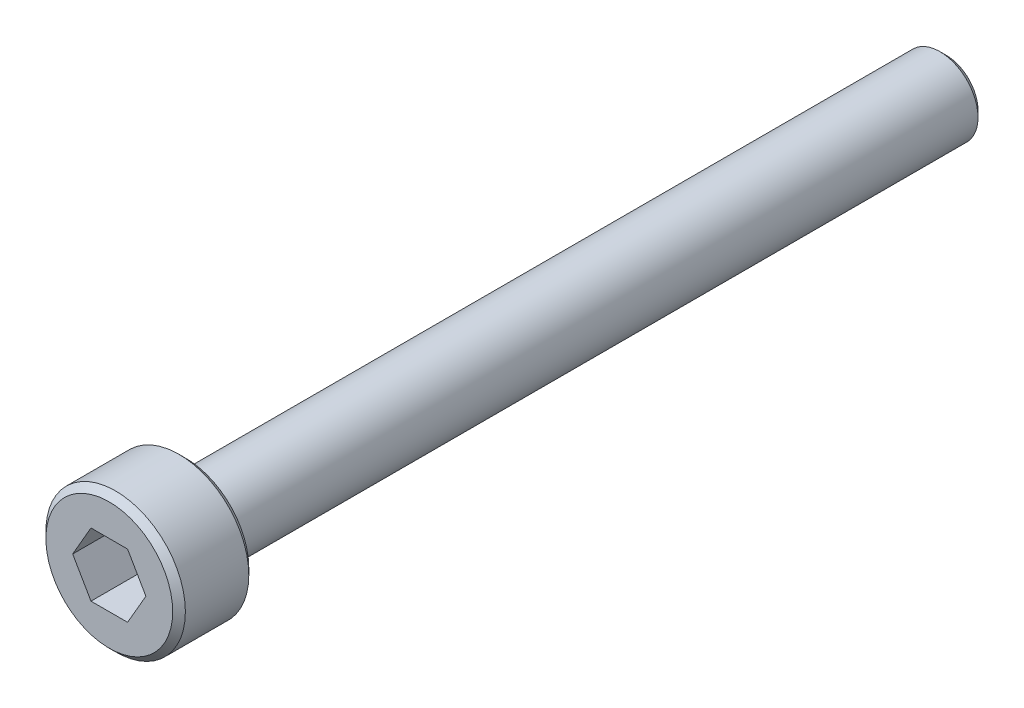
ISO-10303-21;
HEADER;
FILE_DESCRIPTION(('STEP AP214'),'2;1');
FILE_NAME('part.step','',(''),(''),'','','');
FILE_SCHEMA(('AUTOMOTIVE_DESIGN { 1 0 10303 214 1 1 1 1 }'));
ENDSEC;
DATA;
#1=APPLICATION_CONTEXT('core data for automotive mechanical design processes');
#2=APPLICATION_PROTOCOL_DEFINITION('international standard','automotive_design',2000,#1);
#3=PRODUCT_CONTEXT('',#1,'mechanical');
#4=PRODUCT('Part','Part','',(#3));
#5=PRODUCT_RELATED_PRODUCT_CATEGORY('part','',(#4));
#6=PRODUCT_DEFINITION_FORMATION('','',#4);
#7=PRODUCT_DEFINITION_CONTEXT('part definition',#1,'design');
#8=PRODUCT_DEFINITION('design','',#6,#7);
#9=PRODUCT_DEFINITION_SHAPE('','',#8);
#10=(LENGTH_UNIT() NAMED_UNIT(*) SI_UNIT(.MILLI.,.METRE.));
#11=(NAMED_UNIT(*) PLANE_ANGLE_UNIT() SI_UNIT($,.RADIAN.));
#12=(NAMED_UNIT(*) SI_UNIT($,.STERADIAN.) SOLID_ANGLE_UNIT());
#13=UNCERTAINTY_MEASURE_WITH_UNIT(LENGTH_MEASURE(1.E-05),#10,'distance_accuracy_value','');
#14=(GEOMETRIC_REPRESENTATION_CONTEXT(3) GLOBAL_UNCERTAINTY_ASSIGNED_CONTEXT((#13)) GLOBAL_UNIT_ASSIGNED_CONTEXT((#10,
#11,#12)) REPRESENTATION_CONTEXT('',''));
#15=CARTESIAN_POINT('',(0.,0.,0.));
#16=DIRECTION('',(0.,0.,1.));
#17=DIRECTION('',(1.,0.,0.));
#18=AXIS2_PLACEMENT_3D('',#15,#16,#17);
#19=CARTESIAN_POINT('',(0.,0.,30.));
#20=DIRECTION('',(0.,0.,-1.));
#21=DIRECTION('',(-1.,0.,0.));
#22=AXIS2_PLACEMENT_3D('',#19,#20,#21);
#23=CYLINDRICAL_SURFACE('',#22,1.5);
#24=CARTESIAN_POINT('',(0.,0.,0.249999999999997));
#25=DIRECTION('',(0.,0.,1.));
#26=DIRECTION('',(1.,0.,0.));
#27=AXIS2_PLACEMENT_3D('',#24,#25,#26);
#28=CIRCLE('',#27,1.5);
#29=CARTESIAN_POINT('',(1.5,0.,0.249999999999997));
#30=VERTEX_POINT('',#29);
#31=EDGE_CURVE('E187',#30,#30,#28,.T.);
#32=ORIENTED_EDGE('',*,*,#31,.T.);
#33=EDGE_LOOP('',(#32));
#34=FACE_BOUND('',#33,.T.);
#35=CARTESIAN_POINT('',(0.,0.,30.));
#36=DIRECTION('',(0.,0.,1.));
#37=DIRECTION('',(1.,0.,0.));
#38=AXIS2_PLACEMENT_3D('',#35,#36,#37);
#39=CIRCLE('',#38,1.5);
#40=CARTESIAN_POINT('',(1.5,0.,30.));
#41=VERTEX_POINT('',#40);
#42=EDGE_CURVE('E162',#41,#41,#39,.T.);
#43=ORIENTED_EDGE('',*,*,#42,.F.);
#44=EDGE_LOOP('',(#43));
#45=FACE_BOUND('',#44,.T.);
#46=ADVANCED_FACE('F50',(#34,#45),#23,.T.);
#47=CARTESIAN_POINT('',(0.,0.,0.));
#48=DIRECTION('',(0.,0.,1.));
#49=DIRECTION('',(1.,0.,0.));
#50=AXIS2_PLACEMENT_3D('',#47,#48,#49);
#51=PLANE('',#50);
#52=CARTESIAN_POINT('',(0.,0.,0.));
#53=DIRECTION('',(0.,0.,1.));
#54=DIRECTION('',(1.,0.,0.));
#55=AXIS2_PLACEMENT_3D('',#52,#53,#54);
#56=CIRCLE('',#55,1.25);
#57=CARTESIAN_POINT('',(1.25,0.,0.));
#58=VERTEX_POINT('',#57);
#59=EDGE_CURVE('E60',#58,#58,#56,.F.);
#60=ORIENTED_EDGE('',*,*,#59,.T.);
#61=EDGE_LOOP('',(#60));
#62=FACE_BOUND('',#61,.T.);
#63=ADVANCED_FACE('F194',(#62),#51,.F.);
#64=CARTESIAN_POINT('',(0.,0.,33.));
#65=DIRECTION('',(0.,0.,-1.));
#66=DIRECTION('',(-1.,0.,0.));
#67=AXIS2_PLACEMENT_3D('',#64,#65,#66);
#68=CYLINDRICAL_SURFACE('',#67,2.75);
#69=CARTESIAN_POINT('',(0.,0.,30.25));
#70=DIRECTION('',(0.,0.,1.));
#71=DIRECTION('',(1.,0.,0.));
#72=AXIS2_PLACEMENT_3D('',#69,#70,#71);
#73=CIRCLE('',#72,2.75);
#74=CARTESIAN_POINT('',(2.75,0.,30.25));
#75=VERTEX_POINT('',#74);
#76=EDGE_CURVE('E179',#75,#75,#73,.T.);
#77=ORIENTED_EDGE('',*,*,#76,.T.);
#78=EDGE_LOOP('',(#77));
#79=FACE_BOUND('',#78,.T.);
#80=CARTESIAN_POINT('',(0.,0.,32.75));
#81=DIRECTION('',(0.,0.,1.));
#82=DIRECTION('',(1.,0.,0.));
#83=AXIS2_PLACEMENT_3D('',#80,#81,#82);
#84=CIRCLE('',#83,2.75);
#85=CARTESIAN_POINT('',(2.75,0.,32.75));
#86=VERTEX_POINT('',#85);
#87=EDGE_CURVE('E176',#86,#86,#84,.F.);
#88=ORIENTED_EDGE('',*,*,#87,.T.);
#89=EDGE_LOOP('',(#88));
#90=FACE_BOUND('',#89,.T.);
#91=ADVANCED_FACE('F219',(#79,#90),#68,.T.);
#92=CARTESIAN_POINT('',(0.,0.,33.));
#93=DIRECTION('',(0.,0.,1.));
#94=DIRECTION('',(1.,0.,0.));
#95=AXIS2_PLACEMENT_3D('',#92,#93,#94);
#96=PLANE('',#95);
#97=DIRECTION('',(0.5,0.866025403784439,0.));
#98=VECTOR('',#97,1.);
#99=CARTESIAN_POINT('',(0.721687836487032,-1.25,33.));
#100=LINE('',#99,#98);
#101=CARTESIAN_POINT('',(0.721687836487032,-1.25,33.));
#102=VERTEX_POINT('',#101);
#103=CARTESIAN_POINT('',(1.44337567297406,0.,33.));
#104=VERTEX_POINT('',#103);
#105=EDGE_CURVE('E63',#102,#104,#100,.T.);
#106=ORIENTED_EDGE('',*,*,#105,.F.);
#107=DIRECTION('',(1.,0.,0.));
#108=VECTOR('',#107,1.);
#109=CARTESIAN_POINT('',(-0.721687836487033,-1.25,33.));
#110=LINE('',#109,#108);
#111=CARTESIAN_POINT('',(-0.721687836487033,-1.25,33.));
#112=VERTEX_POINT('',#111);
#113=EDGE_CURVE('E160',#112,#102,#110,.T.);
#114=ORIENTED_EDGE('',*,*,#113,.F.);
#115=DIRECTION('',(0.5,-0.866025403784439,0.));
#116=VECTOR('',#115,1.);
#117=CARTESIAN_POINT('',(-1.44337567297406,0.,33.));
#118=LINE('',#117,#116);
#119=CARTESIAN_POINT('',(-1.44337567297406,0.,33.));
#120=VERTEX_POINT('',#119);
#121=EDGE_CURVE('E152',#120,#112,#118,.T.);
#122=ORIENTED_EDGE('',*,*,#121,.F.);
#123=DIRECTION('',(-0.5,-0.866025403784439,0.));
#124=VECTOR('',#123,1.);
#125=CARTESIAN_POINT('',(-0.721687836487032,1.25,33.));
#126=LINE('',#125,#124);
#127=CARTESIAN_POINT('',(-0.721687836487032,1.25,33.));
#128=VERTEX_POINT('',#127);
#129=EDGE_CURVE('E115',#128,#120,#126,.T.);
#130=ORIENTED_EDGE('',*,*,#129,.F.);
#131=DIRECTION('',(-1.,0.,0.));
#132=VECTOR('',#131,1.);
#133=CARTESIAN_POINT('',(0.721687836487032,1.25,33.));
#134=LINE('',#133,#132);
#135=CARTESIAN_POINT('',(0.721687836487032,1.25,33.));
#136=VERTEX_POINT('',#135);
#137=EDGE_CURVE('E146',#136,#128,#134,.T.);
#138=ORIENTED_EDGE('',*,*,#137,.F.);
#139=DIRECTION('',(-0.5,0.866025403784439,0.));
#140=VECTOR('',#139,1.);
#141=CARTESIAN_POINT('',(1.44337567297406,0.,33.));
#142=LINE('',#141,#140);
#143=EDGE_CURVE('E145',#104,#136,#142,.T.);
#144=ORIENTED_EDGE('',*,*,#143,.F.);
#145=EDGE_LOOP('',(#106,#114,#122,#130,#138,#144));
#146=FACE_BOUND('',#145,.T.);
#147=CARTESIAN_POINT('',(0.,0.,33.));
#148=DIRECTION('',(0.,0.,1.));
#149=DIRECTION('',(1.,0.,0.));
#150=AXIS2_PLACEMENT_3D('',#147,#148,#149);
#151=CIRCLE('',#150,2.5);
#152=CARTESIAN_POINT('',(2.5,0.,33.));
#153=VERTEX_POINT('',#152);
#154=EDGE_CURVE('E11',#153,#153,#151,.T.);
#155=ORIENTED_EDGE('',*,*,#154,.T.);
#156=EDGE_LOOP('',(#155));
#157=FACE_BOUND('',#156,.T.);
#158=ADVANCED_FACE('F209',(#146,#157),#96,.T.);
#159=CARTESIAN_POINT('',(0.,0.,30.));
#160=DIRECTION('',(0.,0.,1.));
#161=DIRECTION('',(1.,0.,0.));
#162=AXIS2_PLACEMENT_3D('',#159,#160,#161);
#163=PLANE('',#162);
#164=CARTESIAN_POINT('',(0.,0.,30.));
#165=DIRECTION('',(0.,0.,1.));
#166=DIRECTION('',(1.,0.,0.));
#167=AXIS2_PLACEMENT_3D('',#164,#165,#166);
#168=CIRCLE('',#167,2.5);
#169=CARTESIAN_POINT('',(2.5,0.,30.));
#170=VERTEX_POINT('',#169);
#171=EDGE_CURVE('E184',#170,#170,#168,.F.);
#172=ORIENTED_EDGE('',*,*,#171,.T.);
#173=EDGE_LOOP('',(#172));
#174=FACE_BOUND('',#173,.T.);
#175=ORIENTED_EDGE('',*,*,#42,.T.);
#176=EDGE_LOOP('',(#175));
#177=FACE_BOUND('',#176,.T.);
#178=ADVANCED_FACE('F208',(#174,#177),#163,.F.);
#179=CARTESIAN_POINT('',(0.,0.,30.25));
#180=DIRECTION('',(0.,0.,1.));
#181=DIRECTION('',(1.,0.,0.));
#182=AXIS2_PLACEMENT_3D('',#179,#180,#181);
#183=CONICAL_SURFACE('',#182,2.75,0.78539816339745);
#184=ORIENTED_EDGE('',*,*,#171,.F.);
#185=EDGE_LOOP('',(#184));
#186=FACE_BOUND('',#185,.T.);
#187=ORIENTED_EDGE('',*,*,#76,.F.);
#188=EDGE_LOOP('',(#187));
#189=FACE_BOUND('',#188,.T.);
#190=ADVANCED_FACE('F199',(#186,#189),#183,.T.);
#191=CARTESIAN_POINT('',(0.,0.,0.249999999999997));
#192=DIRECTION('',(0.,0.,1.));
#193=DIRECTION('',(1.,0.,0.));
#194=AXIS2_PLACEMENT_3D('',#191,#192,#193);
#195=CONICAL_SURFACE('',#194,1.5,0.785398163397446);
#196=ORIENTED_EDGE('',*,*,#59,.F.);
#197=EDGE_LOOP('',(#196));
#198=FACE_BOUND('',#197,.T.);
#199=ORIENTED_EDGE('',*,*,#31,.F.);
#200=EDGE_LOOP('',(#199));
#201=FACE_BOUND('',#200,.T.);
#202=ADVANCED_FACE('F197',(#198,#201),#195,.T.);
#203=CARTESIAN_POINT('',(0.,0.,33.));
#204=DIRECTION('',(0.,0.,-1.));
#205=DIRECTION('',(-1.,0.,0.));
#206=AXIS2_PLACEMENT_3D('',#203,#204,#205);
#207=CONICAL_SURFACE('',#206,2.5,0.785398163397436);
#208=ORIENTED_EDGE('',*,*,#87,.F.);
#209=EDGE_LOOP('',(#208));
#210=FACE_BOUND('',#209,.T.);
#211=ORIENTED_EDGE('',*,*,#154,.F.);
#212=EDGE_LOOP('',(#211));
#213=FACE_BOUND('',#212,.T.);
#214=ADVANCED_FACE('F49',(#210,#213),#207,.T.);
#215=CARTESIAN_POINT('',(0.721687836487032,-1.25,31.));
#216=DIRECTION('',(0.866025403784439,-0.5,0.));
#217=DIRECTION('',(0.5,0.866025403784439,0.));
#218=AXIS2_PLACEMENT_3D('',#215,#216,#217);
#219=PLANE('',#218);
#220=ORIENTED_EDGE('',*,*,#105,.T.);
#221=DIRECTION('',(0.,0.,1.));
#222=VECTOR('',#221,1.);
#223=CARTESIAN_POINT('',(1.44337567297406,0.,31.));
#224=LINE('',#223,#222);
#225=CARTESIAN_POINT('',(1.44337567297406,0.,31.));
#226=VERTEX_POINT('',#225);
#227=EDGE_CURVE('E94',#226,#104,#224,.T.);
#228=ORIENTED_EDGE('',*,*,#227,.F.);
#229=DIRECTION('',(0.5,0.866025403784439,0.));
#230=VECTOR('',#229,1.);
#231=CARTESIAN_POINT('',(0.721687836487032,-1.25,31.));
#232=LINE('',#231,#230);
#233=CARTESIAN_POINT('',(0.721687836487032,-1.25,31.));
#234=VERTEX_POINT('',#233);
#235=EDGE_CURVE('E159',#234,#226,#232,.T.);
#236=ORIENTED_EDGE('',*,*,#235,.F.);
#237=DIRECTION('',(0.,0.,1.));
#238=VECTOR('',#237,1.);
#239=CARTESIAN_POINT('',(0.721687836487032,-1.25,31.));
#240=LINE('',#239,#238);
#241=EDGE_CURVE('E75',#234,#102,#240,.T.);
#242=ORIENTED_EDGE('',*,*,#241,.T.);
#243=EDGE_LOOP('',(#220,#228,#236,#242));
#244=FACE_BOUND('',#243,.T.);
#245=ADVANCED_FACE('F279',(#244),#219,.F.);
#246=CARTESIAN_POINT('',(-0.721687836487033,-1.25,31.));
#247=DIRECTION('',(0.,-1.,0.));
#248=DIRECTION('',(1.,0.,0.));
#249=AXIS2_PLACEMENT_3D('',#246,#247,#248);
#250=PLANE('',#249);
#251=ORIENTED_EDGE('',*,*,#113,.T.);
#252=ORIENTED_EDGE('',*,*,#241,.F.);
#253=DIRECTION('',(1.,0.,0.));
#254=VECTOR('',#253,1.);
#255=CARTESIAN_POINT('',(-0.721687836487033,-1.25,31.));
#256=LINE('',#255,#254);
#257=CARTESIAN_POINT('',(-0.721687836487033,-1.25,31.));
#258=VERTEX_POINT('',#257);
#259=EDGE_CURVE('E127',#258,#234,#256,.T.);
#260=ORIENTED_EDGE('',*,*,#259,.F.);
#261=DIRECTION('',(0.,0.,1.));
#262=VECTOR('',#261,1.);
#263=CARTESIAN_POINT('',(-0.721687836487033,-1.25,31.));
#264=LINE('',#263,#262);
#265=EDGE_CURVE('E120',#258,#112,#264,.T.);
#266=ORIENTED_EDGE('',*,*,#265,.T.);
#267=EDGE_LOOP('',(#251,#252,#260,#266));
#268=FACE_BOUND('',#267,.T.);
#269=ADVANCED_FACE('F286',(#268),#250,.F.);
#270=CARTESIAN_POINT('',(-1.44337567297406,0.,31.));
#271=DIRECTION('',(-0.866025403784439,-0.5,0.));
#272=DIRECTION('',(0.5,-0.866025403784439,0.));
#273=AXIS2_PLACEMENT_3D('',#270,#271,#272);
#274=PLANE('',#273);
#275=ORIENTED_EDGE('',*,*,#121,.T.);
#276=ORIENTED_EDGE('',*,*,#265,.F.);
#277=DIRECTION('',(0.5,-0.866025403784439,0.));
#278=VECTOR('',#277,1.);
#279=CARTESIAN_POINT('',(-1.44337567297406,0.,31.));
#280=LINE('',#279,#278);
#281=CARTESIAN_POINT('',(-1.44337567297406,0.,31.));
#282=VERTEX_POINT('',#281);
#283=EDGE_CURVE('E121',#282,#258,#280,.T.);
#284=ORIENTED_EDGE('',*,*,#283,.F.);
#285=DIRECTION('',(0.,0.,1.));
#286=VECTOR('',#285,1.);
#287=CARTESIAN_POINT('',(-1.44337567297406,0.,31.));
#288=LINE('',#287,#286);
#289=EDGE_CURVE('E104',#282,#120,#288,.T.);
#290=ORIENTED_EDGE('',*,*,#289,.T.);
#291=EDGE_LOOP('',(#275,#276,#284,#290));
#292=FACE_BOUND('',#291,.T.);
#293=ADVANCED_FACE('F125',(#292),#274,.F.);
#294=CARTESIAN_POINT('',(-0.721687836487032,1.25,31.));
#295=DIRECTION('',(-0.866025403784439,0.5,0.));
#296=DIRECTION('',(-0.5,-0.866025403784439,0.));
#297=AXIS2_PLACEMENT_3D('',#294,#295,#296);
#298=PLANE('',#297);
#299=ORIENTED_EDGE('',*,*,#129,.T.);
#300=ORIENTED_EDGE('',*,*,#289,.F.);
#301=DIRECTION('',(-0.5,-0.866025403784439,0.));
#302=VECTOR('',#301,1.);
#303=CARTESIAN_POINT('',(-0.721687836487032,1.25,31.));
#304=LINE('',#303,#302);
#305=CARTESIAN_POINT('',(-0.721687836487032,1.25,31.));
#306=VERTEX_POINT('',#305);
#307=EDGE_CURVE('E108',#306,#282,#304,.T.);
#308=ORIENTED_EDGE('',*,*,#307,.F.);
#309=DIRECTION('',(0.,0.,1.));
#310=VECTOR('',#309,1.);
#311=CARTESIAN_POINT('',(-0.721687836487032,1.25,31.));
#312=LINE('',#311,#310);
#313=EDGE_CURVE('E117',#306,#128,#312,.T.);
#314=ORIENTED_EDGE('',*,*,#313,.T.);
#315=EDGE_LOOP('',(#299,#300,#308,#314));
#316=FACE_BOUND('',#315,.T.);
#317=ADVANCED_FACE('F110',(#316),#298,.F.);
#318=CARTESIAN_POINT('',(0.721687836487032,1.25,31.));
#319=DIRECTION('',(0.,1.,0.));
#320=DIRECTION('',(-1.,0.,0.));
#321=AXIS2_PLACEMENT_3D('',#318,#319,#320);
#322=PLANE('',#321);
#323=ORIENTED_EDGE('',*,*,#137,.T.);
#324=ORIENTED_EDGE('',*,*,#313,.F.);
#325=DIRECTION('',(-1.,0.,0.));
#326=VECTOR('',#325,1.);
#327=CARTESIAN_POINT('',(0.721687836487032,1.25,31.));
#328=LINE('',#327,#326);
#329=CARTESIAN_POINT('',(0.721687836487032,1.25,31.));
#330=VERTEX_POINT('',#329);
#331=EDGE_CURVE('E135',#330,#306,#328,.T.);
#332=ORIENTED_EDGE('',*,*,#331,.F.);
#333=DIRECTION('',(0.,0.,1.));
#334=VECTOR('',#333,1.);
#335=CARTESIAN_POINT('',(0.721687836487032,1.25,31.));
#336=LINE('',#335,#334);
#337=EDGE_CURVE('E169',#330,#136,#336,.T.);
#338=ORIENTED_EDGE('',*,*,#337,.T.);
#339=EDGE_LOOP('',(#323,#324,#332,#338));
#340=FACE_BOUND('',#339,.T.);
#341=ADVANCED_FACE('F309',(#340),#322,.F.);
#342=CARTESIAN_POINT('',(1.44337567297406,0.,31.));
#343=DIRECTION('',(0.866025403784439,0.5,0.));
#344=DIRECTION('',(-0.5,0.866025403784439,0.));
#345=AXIS2_PLACEMENT_3D('',#342,#343,#344);
#346=PLANE('',#345);
#347=ORIENTED_EDGE('',*,*,#143,.T.);
#348=ORIENTED_EDGE('',*,*,#337,.F.);
#349=DIRECTION('',(-0.5,0.866025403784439,0.));
#350=VECTOR('',#349,1.);
#351=CARTESIAN_POINT('',(1.44337567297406,0.,31.));
#352=LINE('',#351,#350);
#353=EDGE_CURVE('E136',#226,#330,#352,.T.);
#354=ORIENTED_EDGE('',*,*,#353,.F.);
#355=ORIENTED_EDGE('',*,*,#227,.T.);
#356=EDGE_LOOP('',(#347,#348,#354,#355));
#357=FACE_BOUND('',#356,.T.);
#358=ADVANCED_FACE('F317',(#357),#346,.F.);
#359=CARTESIAN_POINT('',(0.,0.,31.));
#360=DIRECTION('',(0.,0.,1.));
#361=DIRECTION('',(1.,0.,0.));
#362=AXIS2_PLACEMENT_3D('',#359,#360,#361);
#363=PLANE('',#362);
#364=ORIENTED_EDGE('',*,*,#235,.T.);
#365=ORIENTED_EDGE('',*,*,#353,.T.);
#366=ORIENTED_EDGE('',*,*,#331,.T.);
#367=ORIENTED_EDGE('',*,*,#307,.T.);
#368=ORIENTED_EDGE('',*,*,#283,.T.);
#369=ORIENTED_EDGE('',*,*,#259,.T.);
#370=EDGE_LOOP('',(#364,#365,#366,#367,#368,#369));
#371=FACE_BOUND('',#370,.T.);
#372=ADVANCED_FACE('F129',(#371),#363,.T.);
#373=CLOSED_SHELL('',(#46,#63,#91,#158,#178,#190,#202,#214,#245,#269,#293,#317,#341,#358,#372));
#374=MANIFOLD_SOLID_BREP('B2',#373);
#375=ADVANCED_BREP_SHAPE_REPRESENTATION('',(#18,#374),#14);
#376=SHAPE_DEFINITION_REPRESENTATION(#9,#375);
ENDSEC;
END-ISO-10303-21;
